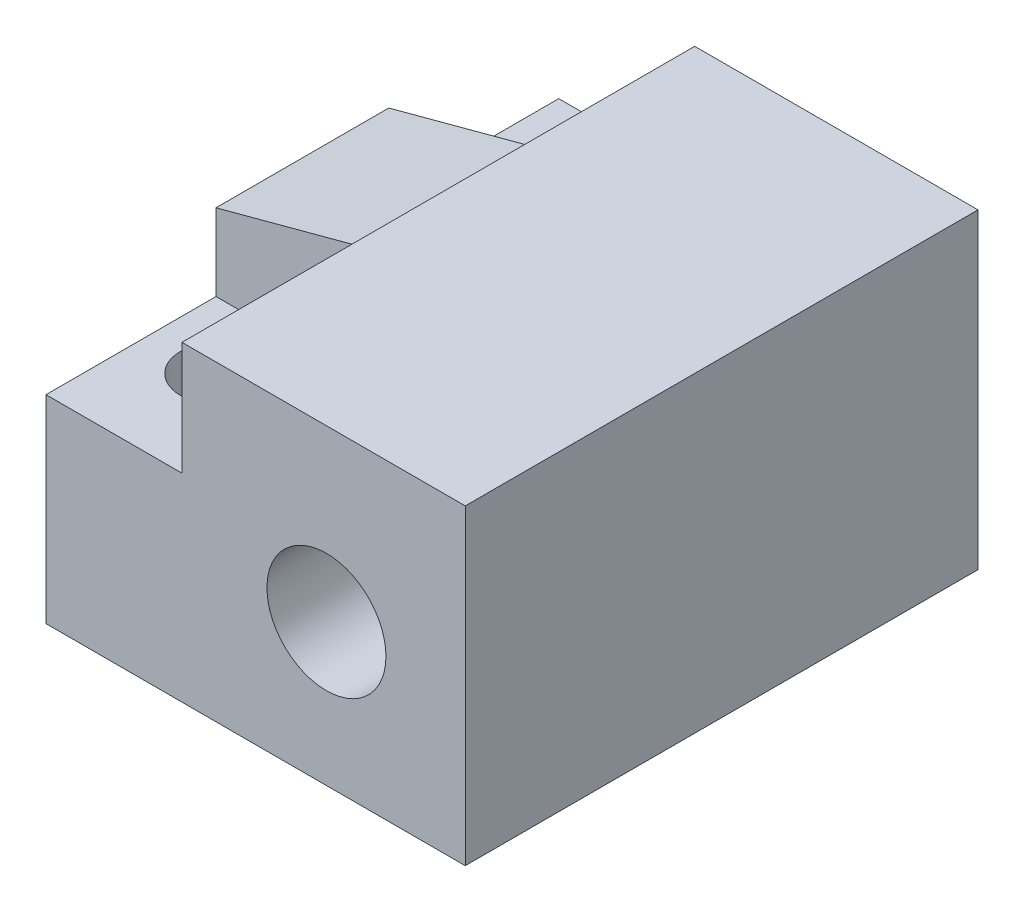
ISO-10303-21;
HEADER;
FILE_DESCRIPTION(('STEP AP214'),'2;1');
FILE_NAME('part.step','',(''),(''),'','','');
FILE_SCHEMA(('AUTOMOTIVE_DESIGN { 1 0 10303 214 1 1 1 1 }'));
ENDSEC;
DATA;
#1=APPLICATION_CONTEXT('core data for automotive mechanical design processes');
#2=APPLICATION_PROTOCOL_DEFINITION('international standard','automotive_design',2000,#1);
#3=PRODUCT_CONTEXT('',#1,'mechanical');
#4=PRODUCT('Part','Part','',(#3));
#5=PRODUCT_RELATED_PRODUCT_CATEGORY('part','',(#4));
#6=PRODUCT_DEFINITION_FORMATION('','',#4);
#7=PRODUCT_DEFINITION_CONTEXT('part definition',#1,'design');
#8=PRODUCT_DEFINITION('design','',#6,#7);
#9=PRODUCT_DEFINITION_SHAPE('','',#8);
#10=(LENGTH_UNIT() NAMED_UNIT(*) SI_UNIT(.MILLI.,.METRE.));
#11=(NAMED_UNIT(*) PLANE_ANGLE_UNIT() SI_UNIT($,.RADIAN.));
#12=(NAMED_UNIT(*) SI_UNIT($,.STERADIAN.) SOLID_ANGLE_UNIT());
#13=UNCERTAINTY_MEASURE_WITH_UNIT(LENGTH_MEASURE(1.E-05),#10,'distance_accuracy_value','');
#14=(GEOMETRIC_REPRESENTATION_CONTEXT(3) GLOBAL_UNCERTAINTY_ASSIGNED_CONTEXT((#13)) GLOBAL_UNIT_ASSIGNED_CONTEXT((#10,
#11,#12)) REPRESENTATION_CONTEXT('',''));
#15=CARTESIAN_POINT('',(0.,0.,0.));
#16=DIRECTION('',(0.,0.,1.));
#17=DIRECTION('',(1.,0.,0.));
#18=AXIS2_PLACEMENT_3D('',#15,#16,#17);
#19=CARTESIAN_POINT('',(0.,9.71384387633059,-18.1));
#20=DIRECTION('',(-1.,0.,0.));
#21=DIRECTION('',(0.,-1.,0.));
#22=AXIS2_PLACEMENT_3D('',#19,#20,#21);
#23=PLANE('',#22);
#24=CARTESIAN_POINT('',(0.,5.,-9.7));
#25=DIRECTION('',(-1.,0.,0.));
#26=DIRECTION('',(0.,0.,1.));
#27=AXIS2_PLACEMENT_3D('',#24,#25,#26);
#28=CIRCLE('',#27,2.1);
#29=CARTESIAN_POINT('',(0.,5.,-7.6));
#30=VERTEX_POINT('',#29);
#31=EDGE_CURVE('E156',#30,#30,#28,.T.);
#32=ORIENTED_EDGE('',*,*,#31,.F.);
#33=EDGE_LOOP('',(#32));
#34=FACE_BOUND('',#33,.T.);
#35=DIRECTION('',(0.,0.,1.));
#36=VECTOR('',#35,1.);
#37=CARTESIAN_POINT('',(0.,9.71384387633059,-18.1));
#38=LINE('',#37,#36);
#39=CARTESIAN_POINT('',(0.,9.7138438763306,-12.1));
#40=VERTEX_POINT('',#39);
#41=CARTESIAN_POINT('',(0.,9.71384387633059,-5.99999999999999));
#42=VERTEX_POINT('',#41);
#43=EDGE_CURVE('E36',#40,#42,#38,.T.);
#44=ORIENTED_EDGE('',*,*,#43,.F.);
#45=DIRECTION('',(0.,-1.,0.));
#46=VECTOR('',#45,1.);
#47=CARTESIAN_POINT('',(0.,11.,-12.1));
#48=LINE('',#47,#46);
#49=CARTESIAN_POINT('',(0.,6.99999999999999,-12.1));
#50=VERTEX_POINT('',#49);
#51=EDGE_CURVE('E132',#40,#50,#48,.T.);
#52=ORIENTED_EDGE('',*,*,#51,.T.);
#53=DIRECTION('',(0.,0.,1.));
#54=VECTOR('',#53,1.);
#55=CARTESIAN_POINT('',(0.,6.99999999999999,-12.1));
#56=LINE('',#55,#54);
#57=CARTESIAN_POINT('',(0.,6.99999999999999,-18.1));
#58=VERTEX_POINT('',#57);
#59=EDGE_CURVE('E122',#58,#50,#56,.T.);
#60=ORIENTED_EDGE('',*,*,#59,.F.);
#61=DIRECTION('',(0.,-1.,0.));
#62=VECTOR('',#61,1.);
#63=CARTESIAN_POINT('',(0.,9.71384387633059,-18.1));
#64=LINE('',#63,#62);
#65=CARTESIAN_POINT('',(0.,0.,-18.1));
#66=VERTEX_POINT('',#65);
#67=EDGE_CURVE('E179',#58,#66,#64,.T.);
#68=ORIENTED_EDGE('',*,*,#67,.T.);
#69=DIRECTION('',(0.,0.,1.));
#70=VECTOR('',#69,1.);
#71=CARTESIAN_POINT('',(0.,0.,-18.1));
#72=LINE('',#71,#70);
#73=CARTESIAN_POINT('',(0.,0.,0.));
#74=VERTEX_POINT('',#73);
#75=EDGE_CURVE('E190',#66,#74,#72,.T.);
#76=ORIENTED_EDGE('',*,*,#75,.T.);
#77=DIRECTION('',(0.,-1.,0.));
#78=VECTOR('',#77,1.);
#79=CARTESIAN_POINT('',(0.,9.7138438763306,0.));
#80=LINE('',#79,#78);
#81=CARTESIAN_POINT('',(0.,7.,0.));
#82=VERTEX_POINT('',#81);
#83=EDGE_CURVE('E168',#82,#74,#80,.T.);
#84=ORIENTED_EDGE('',*,*,#83,.F.);
#85=DIRECTION('',(0.,0.,1.));
#86=VECTOR('',#85,1.);
#87=CARTESIAN_POINT('',(0.,7.,-5.99999999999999));
#88=LINE('',#87,#86);
#89=CARTESIAN_POINT('',(0.,7.,-5.99999999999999));
#90=VERTEX_POINT('',#89);
#91=EDGE_CURVE('E51',#90,#82,#88,.T.);
#92=ORIENTED_EDGE('',*,*,#91,.F.);
#93=DIRECTION('',(0.,-1.,0.));
#94=VECTOR('',#93,1.);
#95=CARTESIAN_POINT('',(0.,11.,-6.));
#96=LINE('',#95,#94);
#97=EDGE_CURVE('E145',#42,#90,#96,.T.);
#98=ORIENTED_EDGE('',*,*,#97,.F.);
#99=EDGE_LOOP('',(#44,#52,#60,#68,#76,#84,#92,#98));
#100=FACE_BOUND('',#99,.T.);
#101=ADVANCED_FACE('F29',(#34,#100),#23,.T.);
#102=CARTESIAN_POINT('',(4.79999999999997,11.,-18.1));
#103=DIRECTION('',(-0.258819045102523,0.965925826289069,0.));
#104=DIRECTION('',(-0.965925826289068,-0.25881904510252,0.));
#105=AXIS2_PLACEMENT_3D('',#102,#103,#104);
#106=PLANE('',#105);
#107=DIRECTION('',(0.,0.,1.));
#108=VECTOR('',#107,1.);
#109=CARTESIAN_POINT('',(4.79999999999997,11.,-18.1));
#110=LINE('',#109,#108);
#111=CARTESIAN_POINT('',(4.79999999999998,11.,-12.1));
#112=VERTEX_POINT('',#111);
#113=CARTESIAN_POINT('',(4.79999999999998,11.,-5.99999999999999));
#114=VERTEX_POINT('',#113);
#115=EDGE_CURVE('E195',#112,#114,#110,.T.);
#116=ORIENTED_EDGE('',*,*,#115,.F.);
#117=DIRECTION('',(-0.965925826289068,-0.25881904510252,0.));
#118=VECTOR('',#117,1.);
#119=CARTESIAN_POINT('',(4.79999999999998,11.,-12.1));
#120=LINE('',#119,#118);
#121=EDGE_CURVE('E11',#112,#40,#120,.T.);
#122=ORIENTED_EDGE('',*,*,#121,.T.);
#123=ORIENTED_EDGE('',*,*,#43,.T.);
#124=DIRECTION('',(0.965925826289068,0.25881904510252,0.));
#125=VECTOR('',#124,1.);
#126=CARTESIAN_POINT('',(4.79999999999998,11.,-5.99999999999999));
#127=LINE('',#126,#125);
#128=EDGE_CURVE('E153',#42,#114,#127,.T.);
#129=ORIENTED_EDGE('',*,*,#128,.T.);
#130=EDGE_LOOP('',(#116,#122,#123,#129));
#131=FACE_BOUND('',#130,.T.);
#132=ADVANCED_FACE('F224',(#131),#106,.T.);
#133=CARTESIAN_POINT('',(0.,0.,-18.1));
#134=DIRECTION('',(0.,0.,1.));
#135=DIRECTION('',(1.,0.,0.));
#136=AXIS2_PLACEMENT_3D('',#133,#134,#135);
#137=PLANE('',#136);
#138=CARTESIAN_POINT('',(9.89999999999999,4.99999999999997,-18.1));
#139=DIRECTION('',(0.,0.,1.));
#140=DIRECTION('',(1.,0.,0.));
#141=AXIS2_PLACEMENT_3D('',#138,#139,#140);
#142=CIRCLE('',#141,2.1);
#143=CARTESIAN_POINT('',(12.,4.99999999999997,-18.1));
#144=VERTEX_POINT('',#143);
#145=EDGE_CURVE('E165',#144,#144,#142,.T.);
#146=ORIENTED_EDGE('',*,*,#145,.T.);
#147=EDGE_LOOP('',(#146));
#148=FACE_BOUND('',#147,.T.);
#149=DIRECTION('',(0.,-1.,0.));
#150=VECTOR('',#149,1.);
#151=CARTESIAN_POINT('',(4.79999999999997,11.,-18.1));
#152=LINE('',#151,#150);
#153=CARTESIAN_POINT('',(4.79999999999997,11.,-18.1));
#154=VERTEX_POINT('',#153);
#155=CARTESIAN_POINT('',(4.79999999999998,6.99999999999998,-18.1));
#156=VERTEX_POINT('',#155);
#157=EDGE_CURVE('E43',#154,#156,#152,.T.);
#158=ORIENTED_EDGE('',*,*,#157,.F.);
#159=DIRECTION('',(-1.,0.,0.));
#160=VECTOR('',#159,1.);
#161=CARTESIAN_POINT('',(14.8,11.,-18.1));
#162=LINE('',#161,#160);
#163=CARTESIAN_POINT('',(14.8,11.,-18.1));
#164=VERTEX_POINT('',#163);
#165=EDGE_CURVE('E187',#164,#154,#162,.T.);
#166=ORIENTED_EDGE('',*,*,#165,.F.);
#167=DIRECTION('',(0.,1.,0.));
#168=VECTOR('',#167,1.);
#169=CARTESIAN_POINT('',(14.8,0.,-18.1));
#170=LINE('',#169,#168);
#171=CARTESIAN_POINT('',(14.8,0.,-18.1));
#172=VERTEX_POINT('',#171);
#173=EDGE_CURVE('E184',#172,#164,#170,.T.);
#174=ORIENTED_EDGE('',*,*,#173,.F.);
#175=DIRECTION('',(1.,0.,0.));
#176=VECTOR('',#175,1.);
#177=CARTESIAN_POINT('',(0.,0.,-18.1));
#178=LINE('',#177,#176);
#179=EDGE_CURVE('E181',#66,#172,#178,.T.);
#180=ORIENTED_EDGE('',*,*,#179,.F.);
#181=ORIENTED_EDGE('',*,*,#67,.F.);
#182=DIRECTION('',(-1.,0.,0.));
#183=VECTOR('',#182,1.);
#184=CARTESIAN_POINT('',(4.79999999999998,6.99999999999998,-18.1));
#185=LINE('',#184,#183);
#186=EDGE_CURVE('E112',#156,#58,#185,.T.);
#187=ORIENTED_EDGE('',*,*,#186,.F.);
#188=EDGE_LOOP('',(#158,#166,#174,#180,#181,#187));
#189=FACE_BOUND('',#188,.T.);
#190=ADVANCED_FACE('F230',(#148,#189),#137,.F.);
#191=CARTESIAN_POINT('',(0.,0.,0.));
#192=DIRECTION('',(0.,0.,1.));
#193=DIRECTION('',(1.,0.,0.));
#194=AXIS2_PLACEMENT_3D('',#191,#192,#193);
#195=PLANE('',#194);
#196=CARTESIAN_POINT('',(9.90000000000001,4.99999999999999,0.));
#197=DIRECTION('',(0.,0.,1.));
#198=DIRECTION('',(1.,0.,0.));
#199=AXIS2_PLACEMENT_3D('',#196,#197,#198);
#200=CIRCLE('',#199,2.1);
#201=CARTESIAN_POINT('',(12.,4.99999999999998,0.));
#202=VERTEX_POINT('',#201);
#203=EDGE_CURVE('E162',#202,#202,#200,.T.);
#204=ORIENTED_EDGE('',*,*,#203,.F.);
#205=EDGE_LOOP('',(#204));
#206=FACE_BOUND('',#205,.T.);
#207=DIRECTION('',(-1.,0.,0.));
#208=VECTOR('',#207,1.);
#209=CARTESIAN_POINT('',(14.8,11.,0.));
#210=LINE('',#209,#208);
#211=CARTESIAN_POINT('',(14.8,11.,0.));
#212=VERTEX_POINT('',#211);
#213=CARTESIAN_POINT('',(4.79999999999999,11.,0.));
#214=VERTEX_POINT('',#213);
#215=EDGE_CURVE('E176',#212,#214,#210,.T.);
#216=ORIENTED_EDGE('',*,*,#215,.T.);
#217=DIRECTION('',(0.,-1.,0.));
#218=VECTOR('',#217,1.);
#219=CARTESIAN_POINT('',(4.79999999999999,11.,0.));
#220=LINE('',#219,#218);
#221=CARTESIAN_POINT('',(4.8,7.,0.));
#222=VERTEX_POINT('',#221);
#223=EDGE_CURVE('E150',#214,#222,#220,.T.);
#224=ORIENTED_EDGE('',*,*,#223,.T.);
#225=DIRECTION('',(1.,0.,0.));
#226=VECTOR('',#225,1.);
#227=CARTESIAN_POINT('',(4.8,7.,0.));
#228=LINE('',#227,#226);
#229=EDGE_CURVE('E136',#82,#222,#228,.T.);
#230=ORIENTED_EDGE('',*,*,#229,.F.);
#231=ORIENTED_EDGE('',*,*,#83,.T.);
#232=DIRECTION('',(1.,0.,0.));
#233=VECTOR('',#232,1.);
#234=CARTESIAN_POINT('',(0.,0.,0.));
#235=LINE('',#234,#233);
#236=CARTESIAN_POINT('',(14.8,0.,0.));
#237=VERTEX_POINT('',#236);
#238=EDGE_CURVE('E170',#74,#237,#235,.T.);
#239=ORIENTED_EDGE('',*,*,#238,.T.);
#240=DIRECTION('',(0.,1.,0.));
#241=VECTOR('',#240,1.);
#242=CARTESIAN_POINT('',(14.8,0.,0.));
#243=LINE('',#242,#241);
#244=EDGE_CURVE('E173',#237,#212,#243,.T.);
#245=ORIENTED_EDGE('',*,*,#244,.T.);
#246=EDGE_LOOP('',(#216,#224,#230,#231,#239,#245));
#247=FACE_BOUND('',#246,.T.);
#248=ADVANCED_FACE('F211',(#206,#247),#195,.T.);
#249=CARTESIAN_POINT('',(14.8,11.,-18.1));
#250=DIRECTION('',(0.,1.,0.));
#251=DIRECTION('',(-1.,0.,0.));
#252=AXIS2_PLACEMENT_3D('',#249,#250,#251);
#253=PLANE('',#252);
#254=ORIENTED_EDGE('',*,*,#215,.F.);
#255=DIRECTION('',(0.,0.,1.));
#256=VECTOR('',#255,1.);
#257=CARTESIAN_POINT('',(14.8,11.,-18.1));
#258=LINE('',#257,#256);
#259=EDGE_CURVE('E196',#164,#212,#258,.T.);
#260=ORIENTED_EDGE('',*,*,#259,.F.);
#261=ORIENTED_EDGE('',*,*,#165,.T.);
#262=EDGE_CURVE('E192',#154,#112,#110,.T.);
#263=ORIENTED_EDGE('',*,*,#262,.T.);
#264=ORIENTED_EDGE('',*,*,#115,.T.);
#265=DIRECTION('',(0.,0.,-1.));
#266=VECTOR('',#265,1.);
#267=CARTESIAN_POINT('',(4.79999999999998,11.,-5.99999999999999));
#268=LINE('',#267,#266);
#269=EDGE_CURVE('E142',#214,#114,#268,.T.);
#270=ORIENTED_EDGE('',*,*,#269,.F.);
#271=EDGE_LOOP('',(#254,#260,#261,#263,#264,#270));
#272=FACE_BOUND('',#271,.T.);
#273=ADVANCED_FACE('F227',(#272),#253,.T.);
#274=CARTESIAN_POINT('',(14.8,0.,-18.1));
#275=DIRECTION('',(1.,0.,0.));
#276=DIRECTION('',(0.,0.,-1.));
#277=AXIS2_PLACEMENT_3D('',#274,#275,#276);
#278=PLANE('',#277);
#279=ORIENTED_EDGE('',*,*,#244,.F.);
#280=DIRECTION('',(0.,0.,1.));
#281=VECTOR('',#280,1.);
#282=CARTESIAN_POINT('',(14.8,0.,-18.1));
#283=LINE('',#282,#281);
#284=EDGE_CURVE('E198',#172,#237,#283,.T.);
#285=ORIENTED_EDGE('',*,*,#284,.F.);
#286=ORIENTED_EDGE('',*,*,#173,.T.);
#287=ORIENTED_EDGE('',*,*,#259,.T.);
#288=EDGE_LOOP('',(#279,#285,#286,#287));
#289=FACE_BOUND('',#288,.T.);
#290=ADVANCED_FACE('F233',(#289),#278,.T.);
#291=CARTESIAN_POINT('',(0.,0.,-18.1));
#292=DIRECTION('',(0.,-1.,0.));
#293=DIRECTION('',(0.,0.,-1.));
#294=AXIS2_PLACEMENT_3D('',#291,#292,#293);
#295=PLANE('',#294);
#296=CARTESIAN_POINT('',(2.4,0.,-15.7));
#297=DIRECTION('',(0.,1.,0.));
#298=DIRECTION('',(0.,0.,1.));
#299=AXIS2_PLACEMENT_3D('',#296,#297,#298);
#300=CIRCLE('',#299,1.35);
#301=CARTESIAN_POINT('',(2.4,0.,-14.35));
#302=VERTEX_POINT('',#301);
#303=EDGE_CURVE('E361',#302,#302,#300,.T.);
#304=ORIENTED_EDGE('',*,*,#303,.T.);
#305=EDGE_LOOP('',(#304));
#306=FACE_BOUND('',#305,.T.);
#307=CARTESIAN_POINT('',(2.40000000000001,0.,-3.7));
#308=DIRECTION('',(0.,1.,0.));
#309=DIRECTION('',(0.,0.,1.));
#310=AXIS2_PLACEMENT_3D('',#307,#308,#309);
#311=CIRCLE('',#310,1.35);
#312=CARTESIAN_POINT('',(2.40000000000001,0.,-2.35));
#313=VERTEX_POINT('',#312);
#314=EDGE_CURVE('E123',#313,#313,#311,.T.);
#315=ORIENTED_EDGE('',*,*,#314,.T.);
#316=EDGE_LOOP('',(#315));
#317=FACE_BOUND('',#316,.T.);
#318=ORIENTED_EDGE('',*,*,#238,.F.);
#319=ORIENTED_EDGE('',*,*,#75,.F.);
#320=ORIENTED_EDGE('',*,*,#179,.T.);
#321=ORIENTED_EDGE('',*,*,#284,.T.);
#322=EDGE_LOOP('',(#318,#319,#320,#321));
#323=FACE_BOUND('',#322,.T.);
#324=ADVANCED_FACE('F208',(#306,#317,#323),#295,.T.);
#325=CARTESIAN_POINT('',(9.89999999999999,4.99999999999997,-18.1));
#326=DIRECTION('',(0.,0.,1.));
#327=DIRECTION('',(1.,0.,0.));
#328=AXIS2_PLACEMENT_3D('',#325,#326,#327);
#329=CYLINDRICAL_SURFACE('',#328,2.1);
#330=CARTESIAN_POINT('',(12.,4.99999999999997,-18.1));
#331=CARTESIAN_POINT('',(12.,4.99999999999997,-17.9114583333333));
#332=CARTESIAN_POINT('',(12.,4.99999999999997,-17.7229166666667));
#333=CARTESIAN_POINT('',(12.,4.99999999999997,-17.3458333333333));
#334=CARTESIAN_POINT('',(12.,4.99999999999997,-17.1572916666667));
#335=CARTESIAN_POINT('',(12.,4.99999999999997,-16.7802083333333));
#336=CARTESIAN_POINT('',(12.,4.99999999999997,-16.5916666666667));
#337=CARTESIAN_POINT('',(12.,4.99999999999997,-16.2145833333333));
#338=CARTESIAN_POINT('',(12.,4.99999999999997,-16.0260416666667));
#339=CARTESIAN_POINT('',(12.,4.99999999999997,-15.6489583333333));
#340=CARTESIAN_POINT('',(12.,4.99999999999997,-15.4604166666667));
#341=CARTESIAN_POINT('',(12.,4.99999999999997,-15.0833333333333));
#342=CARTESIAN_POINT('',(12.,4.99999999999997,-14.8947916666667));
#343=CARTESIAN_POINT('',(12.,4.99999999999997,-14.5177083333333));
#344=CARTESIAN_POINT('',(12.,4.99999999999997,-14.3291666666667));
#345=CARTESIAN_POINT('',(12.,4.99999999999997,-13.9520833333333));
#346=CARTESIAN_POINT('',(12.,4.99999999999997,-13.7635416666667));
#347=CARTESIAN_POINT('',(12.,4.99999999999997,-13.3864583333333));
#348=CARTESIAN_POINT('',(12.,4.99999999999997,-13.1979166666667));
#349=CARTESIAN_POINT('',(12.,4.99999999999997,-12.8208333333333));
#350=CARTESIAN_POINT('',(12.,4.99999999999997,-12.6322916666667));
#351=CARTESIAN_POINT('',(12.,4.99999999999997,-12.2552083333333));
#352=CARTESIAN_POINT('',(12.,4.99999999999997,-12.0666666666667));
#353=CARTESIAN_POINT('',(12.,4.99999999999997,-11.6895833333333));
#354=CARTESIAN_POINT('',(12.,4.99999999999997,-11.5010416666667));
#355=CARTESIAN_POINT('',(12.,4.99999999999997,-11.1239583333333));
#356=CARTESIAN_POINT('',(12.,4.99999999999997,-10.9354166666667));
#357=CARTESIAN_POINT('',(12.,4.99999999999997,-10.5583333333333));
#358=CARTESIAN_POINT('',(12.,4.99999999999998,-10.3697916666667));
#359=CARTESIAN_POINT('',(12.,4.99999999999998,-9.99270833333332));
#360=CARTESIAN_POINT('',(12.,4.99999999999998,-9.80416666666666));
#361=CARTESIAN_POINT('',(12.,4.99999999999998,-9.42708333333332));
#362=CARTESIAN_POINT('',(12.,4.99999999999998,-9.23854166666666));
#363=CARTESIAN_POINT('',(12.,4.99999999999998,-8.86145833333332));
#364=CARTESIAN_POINT('',(12.,4.99999999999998,-8.67291666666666));
#365=CARTESIAN_POINT('',(12.,4.99999999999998,-8.29583333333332));
#366=CARTESIAN_POINT('',(12.,4.99999999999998,-8.10729166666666));
#367=CARTESIAN_POINT('',(12.,4.99999999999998,-7.73020833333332));
#368=CARTESIAN_POINT('',(12.,4.99999999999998,-7.54166666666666));
#369=CARTESIAN_POINT('',(12.,4.99999999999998,-7.16458333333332));
#370=CARTESIAN_POINT('',(12.,4.99999999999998,-6.97604166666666));
#371=CARTESIAN_POINT('',(12.,4.99999999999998,-6.59895833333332));
#372=CARTESIAN_POINT('',(12.,4.99999999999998,-6.41041666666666));
#373=CARTESIAN_POINT('',(12.,4.99999999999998,-6.03333333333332));
#374=CARTESIAN_POINT('',(12.,4.99999999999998,-5.84479166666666));
#375=CARTESIAN_POINT('',(12.,4.99999999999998,-5.46770833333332));
#376=CARTESIAN_POINT('',(12.,4.99999999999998,-5.27916666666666));
#377=CARTESIAN_POINT('',(12.,4.99999999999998,-4.90208333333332));
#378=CARTESIAN_POINT('',(12.,4.99999999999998,-4.71354166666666));
#379=CARTESIAN_POINT('',(12.,4.99999999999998,-4.33645833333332));
#380=CARTESIAN_POINT('',(12.,4.99999999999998,-4.14791666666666));
#381=CARTESIAN_POINT('',(12.,4.99999999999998,-3.77083333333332));
#382=CARTESIAN_POINT('',(12.,4.99999999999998,-3.58229166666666));
#383=CARTESIAN_POINT('',(12.,4.99999999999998,-3.20520833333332));
#384=CARTESIAN_POINT('',(12.,4.99999999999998,-3.01666666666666));
#385=CARTESIAN_POINT('',(12.,4.99999999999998,-2.63958333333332));
#386=CARTESIAN_POINT('',(12.,4.99999999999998,-2.45104166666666));
#387=CARTESIAN_POINT('',(12.,4.99999999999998,-2.07395833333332));
#388=CARTESIAN_POINT('',(12.,4.99999999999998,-1.88541666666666));
#389=CARTESIAN_POINT('',(12.,4.99999999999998,-1.50833333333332));
#390=CARTESIAN_POINT('',(12.,4.99999999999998,-1.31979166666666));
#391=CARTESIAN_POINT('',(12.,4.99999999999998,-0.942708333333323));
#392=CARTESIAN_POINT('',(12.,4.99999999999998,-0.754166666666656));
#393=CARTESIAN_POINT('',(12.,4.99999999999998,-0.377083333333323));
#394=CARTESIAN_POINT('',(12.,4.99999999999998,-0.188541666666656));
#395=CARTESIAN_POINT('',(12.,4.99999999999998,0.));
#396=B_SPLINE_CURVE_WITH_KNOTS('',3,(#330,#331,#332,#333,#334,#335,#336,#337,#338,#339,#340,
#341,#342,#343,#344,#345,#346,#347,#348,#349,#350,#351,#352,#353,#354,#355,#356,#357,#358,#359,
#360,#361,#362,#363,#364,#365,#366,#367,#368,#369,#370,#371,#372,#373,#374,#375,#376,#377,#378,
#379,#380,#381,#382,#383,#384,#385,#386,#387,#388,#389,#390,#391,#392,#393,#394,#395),
.UNSPECIFIED.,.F.,.F.,(4,2,2,2,2,2,2,2,2,2,2,2,2,2,2,2,2,2,2,2,2,2,2,2,2,2,2,2,2,2,2,2,4),(0.,
0.565624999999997,1.13125,1.696875,2.2625,2.828125,3.39375,3.959375,4.525,5.090625,5.65625,
6.221875,6.7875,7.353125,7.91875,8.484375,9.05,9.615625,10.18125,10.746875,11.3125,11.878125,
12.44375,13.009375,13.575,14.140625,14.70625,15.271875,15.8375,16.403125,16.96875,17.534375,
18.1),.UNSPECIFIED.);
#397=EDGE_CURVE('BSEAM240',#144,#202,#396,.T.);
#398=ORIENTED_EDGE('',*,*,#145,.F.);
#399=ORIENTED_EDGE('',*,*,#203,.T.);
#400=ORIENTED_EDGE('',*,*,#397,.T.);
#401=ORIENTED_EDGE('',*,*,#397,.F.);
#402=EDGE_LOOP('',(#398,#400,#399,#401));
#403=FACE_BOUND('',#402,.T.);
#404=ADVANCED_FACE('F240',(#403),#329,.F.);
#405=CARTESIAN_POINT('',(6.00000000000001,4.99999999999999,-9.69999999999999));
#406=DIRECTION('',(-1.,0.,0.));
#407=DIRECTION('',(0.,0.,1.));
#408=AXIS2_PLACEMENT_3D('',#405,#406,#407);
#409=CYLINDRICAL_SURFACE('',#408,2.1);
#410=CARTESIAN_POINT('',(6.00000000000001,4.99999999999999,-9.69999999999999));
#411=DIRECTION('',(-1.,0.,0.));
#412=DIRECTION('',(0.,0.,1.));
#413=AXIS2_PLACEMENT_3D('',#410,#411,#412);
#414=CIRCLE('',#413,2.1);
#415=CARTESIAN_POINT('',(6.00000000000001,4.99999999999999,-7.59999999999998));
#416=VERTEX_POINT('',#415);
#417=EDGE_CURVE('E159',#416,#416,#414,.T.);
#418=ORIENTED_EDGE('',*,*,#417,.F.);
#419=EDGE_LOOP('',(#418));
#420=FACE_BOUND('',#419,.T.);
#421=ORIENTED_EDGE('',*,*,#31,.T.);
#422=EDGE_LOOP('',(#421));
#423=FACE_BOUND('',#422,.T.);
#424=ADVANCED_FACE('F251',(#420,#423),#409,.F.);
#425=CARTESIAN_POINT('',(6.00000000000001,4.99999999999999,-9.69999999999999));
#426=DIRECTION('',(-1.,0.,0.));
#427=DIRECTION('',(0.,0.,1.));
#428=AXIS2_PLACEMENT_3D('',#425,#426,#427);
#429=PLANE('',#428);
#430=ORIENTED_EDGE('',*,*,#417,.T.);
#431=EDGE_LOOP('',(#430));
#432=FACE_BOUND('',#431,.T.);
#433=ADVANCED_FACE('F253',(#432),#429,.T.);
#434=CARTESIAN_POINT('',(4.79999999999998,11.,-5.99999999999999));
#435=DIRECTION('',(-1.,0.,0.));
#436=DIRECTION('',(0.,0.,1.));
#437=AXIS2_PLACEMENT_3D('',#434,#435,#436);
#438=PLANE('',#437);
#439=DIRECTION('',(0.,0.,-1.));
#440=VECTOR('',#439,1.);
#441=CARTESIAN_POINT('',(4.79999999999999,6.99999999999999,-5.99999999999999));
#442=LINE('',#441,#440);
#443=CARTESIAN_POINT('',(4.79999999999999,6.99999999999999,-5.99999999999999));
#444=VERTEX_POINT('',#443);
#445=EDGE_CURVE('E138',#222,#444,#442,.T.);
#446=ORIENTED_EDGE('',*,*,#445,.F.);
#447=ORIENTED_EDGE('',*,*,#223,.F.);
#448=ORIENTED_EDGE('',*,*,#269,.T.);
#449=DIRECTION('',(0.,-1.,0.));
#450=VECTOR('',#449,1.);
#451=CARTESIAN_POINT('',(4.79999999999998,11.,-5.99999999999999));
#452=LINE('',#451,#450);
#453=EDGE_CURVE('E147',#114,#444,#452,.T.);
#454=ORIENTED_EDGE('',*,*,#453,.T.);
#455=EDGE_LOOP('',(#446,#447,#448,#454));
#456=FACE_BOUND('',#455,.T.);
#457=ADVANCED_FACE('F215',(#456),#438,.T.);
#458=CARTESIAN_POINT('',(4.79999999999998,11.,-5.99999999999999));
#459=DIRECTION('',(0.,0.,1.));
#460=DIRECTION('',(1.,0.,0.));
#461=AXIS2_PLACEMENT_3D('',#458,#459,#460);
#462=PLANE('',#461);
#463=ORIENTED_EDGE('',*,*,#97,.T.);
#464=DIRECTION('',(-1.,0.,0.));
#465=VECTOR('',#464,1.);
#466=CARTESIAN_POINT('',(4.79999999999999,6.99999999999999,-5.99999999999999));
#467=LINE('',#466,#465);
#468=EDGE_CURVE('E140',#444,#90,#467,.T.);
#469=ORIENTED_EDGE('',*,*,#468,.F.);
#470=ORIENTED_EDGE('',*,*,#453,.F.);
#471=ORIENTED_EDGE('',*,*,#128,.F.);
#472=EDGE_LOOP('',(#463,#469,#470,#471));
#473=FACE_BOUND('',#472,.T.);
#474=ADVANCED_FACE('F221',(#473),#462,.T.);
#475=CARTESIAN_POINT('',(0.,7.,0.));
#476=DIRECTION('',(0.,-1.,0.));
#477=DIRECTION('',(0.,0.,-1.));
#478=AXIS2_PLACEMENT_3D('',#475,#476,#477);
#479=PLANE('',#478);
#480=CARTESIAN_POINT('',(2.39999999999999,6.99999999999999,-3.69999999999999));
#481=DIRECTION('',(0.,1.,0.));
#482=DIRECTION('',(0.,0.,1.));
#483=AXIS2_PLACEMENT_3D('',#480,#481,#482);
#484=CIRCLE('',#483,1.35);
#485=CARTESIAN_POINT('',(2.39999999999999,6.99999999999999,-2.34999999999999));
#486=VERTEX_POINT('',#485);
#487=EDGE_CURVE('E126',#486,#486,#484,.T.);
#488=ORIENTED_EDGE('',*,*,#487,.F.);
#489=EDGE_LOOP('',(#488));
#490=FACE_BOUND('',#489,.T.);
#491=ORIENTED_EDGE('',*,*,#91,.T.);
#492=ORIENTED_EDGE('',*,*,#229,.T.);
#493=ORIENTED_EDGE('',*,*,#445,.T.);
#494=ORIENTED_EDGE('',*,*,#468,.T.);
#495=EDGE_LOOP('',(#491,#492,#493,#494));
#496=FACE_BOUND('',#495,.T.);
#497=ADVANCED_FACE('F213',(#490,#496),#479,.F.);
#498=CARTESIAN_POINT('',(4.79999999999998,11.,-12.1));
#499=DIRECTION('',(0.,0.,-1.));
#500=DIRECTION('',(-1.,0.,0.));
#501=AXIS2_PLACEMENT_3D('',#498,#499,#500);
#502=PLANE('',#501);
#503=DIRECTION('',(0.,-1.,0.));
#504=VECTOR('',#503,1.);
#505=CARTESIAN_POINT('',(4.79999999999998,11.,-12.1));
#506=LINE('',#505,#504);
#507=CARTESIAN_POINT('',(4.79999999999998,6.99999999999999,-12.1));
#508=VERTEX_POINT('',#507);
#509=EDGE_CURVE('E107',#112,#508,#506,.T.);
#510=ORIENTED_EDGE('',*,*,#509,.T.);
#511=DIRECTION('',(1.,0.,0.));
#512=VECTOR('',#511,1.);
#513=CARTESIAN_POINT('',(4.79999999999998,6.99999999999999,-12.1));
#514=LINE('',#513,#512);
#515=EDGE_CURVE('E113',#50,#508,#514,.T.);
#516=ORIENTED_EDGE('',*,*,#515,.F.);
#517=ORIENTED_EDGE('',*,*,#51,.F.);
#518=ORIENTED_EDGE('',*,*,#121,.F.);
#519=EDGE_LOOP('',(#510,#516,#517,#518));
#520=FACE_BOUND('',#519,.T.);
#521=ADVANCED_FACE('F117',(#520),#502,.T.);
#522=CARTESIAN_POINT('',(4.79999999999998,11.,-12.1));
#523=DIRECTION('',(-1.,0.,0.));
#524=DIRECTION('',(0.,0.,1.));
#525=AXIS2_PLACEMENT_3D('',#522,#523,#524);
#526=PLANE('',#525);
#527=DIRECTION('',(0.,0.,-1.));
#528=VECTOR('',#527,1.);
#529=CARTESIAN_POINT('',(4.79999999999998,6.99999999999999,-12.1));
#530=LINE('',#529,#528);
#531=EDGE_CURVE('E104',#508,#156,#530,.T.);
#532=ORIENTED_EDGE('',*,*,#531,.F.);
#533=ORIENTED_EDGE('',*,*,#509,.F.);
#534=ORIENTED_EDGE('',*,*,#262,.F.);
#535=ORIENTED_EDGE('',*,*,#157,.T.);
#536=EDGE_LOOP('',(#532,#533,#534,#535));
#537=FACE_BOUND('',#536,.T.);
#538=ADVANCED_FACE('F106',(#537),#526,.T.);
#539=CARTESIAN_POINT('',(0.,6.99999999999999,-12.1));
#540=DIRECTION('',(0.,-1.,0.));
#541=DIRECTION('',(0.,0.,-1.));
#542=AXIS2_PLACEMENT_3D('',#539,#540,#541);
#543=PLANE('',#542);
#544=CARTESIAN_POINT('',(2.39999999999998,6.99999999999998,-15.7));
#545=DIRECTION('',(0.,1.,0.));
#546=DIRECTION('',(0.,0.,1.));
#547=AXIS2_PLACEMENT_3D('',#544,#545,#546);
#548=CIRCLE('',#547,1.35);
#549=CARTESIAN_POINT('',(2.39999999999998,6.99999999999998,-14.35));
#550=VERTEX_POINT('',#549);
#551=EDGE_CURVE('E364',#550,#550,#548,.T.);
#552=ORIENTED_EDGE('',*,*,#551,.F.);
#553=EDGE_LOOP('',(#552));
#554=FACE_BOUND('',#553,.T.);
#555=ORIENTED_EDGE('',*,*,#515,.T.);
#556=ORIENTED_EDGE('',*,*,#531,.T.);
#557=ORIENTED_EDGE('',*,*,#186,.T.);
#558=ORIENTED_EDGE('',*,*,#59,.T.);
#559=EDGE_LOOP('',(#555,#556,#557,#558));
#560=FACE_BOUND('',#559,.T.);
#561=ADVANCED_FACE('F120',(#554,#560),#543,.F.);
#562=CARTESIAN_POINT('',(2.40000000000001,0.,-3.7));
#563=DIRECTION('',(0.,1.,0.));
#564=DIRECTION('',(0.,0.,1.));
#565=AXIS2_PLACEMENT_3D('',#562,#563,#564);
#566=CYLINDRICAL_SURFACE('',#565,1.35);
#567=ORIENTED_EDGE('',*,*,#314,.F.);
#568=EDGE_LOOP('',(#567));
#569=FACE_BOUND('',#568,.T.);
#570=ORIENTED_EDGE('',*,*,#487,.T.);
#571=EDGE_LOOP('',(#570));
#572=FACE_BOUND('',#571,.T.);
#573=ADVANCED_FACE('F339',(#569,#572),#566,.F.);
#574=CARTESIAN_POINT('',(2.4,0.,-15.7));
#575=DIRECTION('',(0.,1.,0.));
#576=DIRECTION('',(0.,0.,1.));
#577=AXIS2_PLACEMENT_3D('',#574,#575,#576);
#578=CYLINDRICAL_SURFACE('',#577,1.35);
#579=ORIENTED_EDGE('',*,*,#303,.F.);
#580=EDGE_LOOP('',(#579));
#581=FACE_BOUND('',#580,.T.);
#582=ORIENTED_EDGE('',*,*,#551,.T.);
#583=EDGE_LOOP('',(#582));
#584=FACE_BOUND('',#583,.T.);
#585=ADVANCED_FACE('F347',(#581,#584),#578,.F.);
#586=CLOSED_SHELL('',(#101,#132,#190,#248,#273,#290,#324,#404,#424,#433,#457,#474,#497,#521,
#538,#561,#573,#585));
#587=MANIFOLD_SOLID_BREP('B2',#586);
#588=ADVANCED_BREP_SHAPE_REPRESENTATION('',(#18,#587),#14);
#589=SHAPE_DEFINITION_REPRESENTATION(#9,#588);
ENDSEC;
END-ISO-10303-21;
